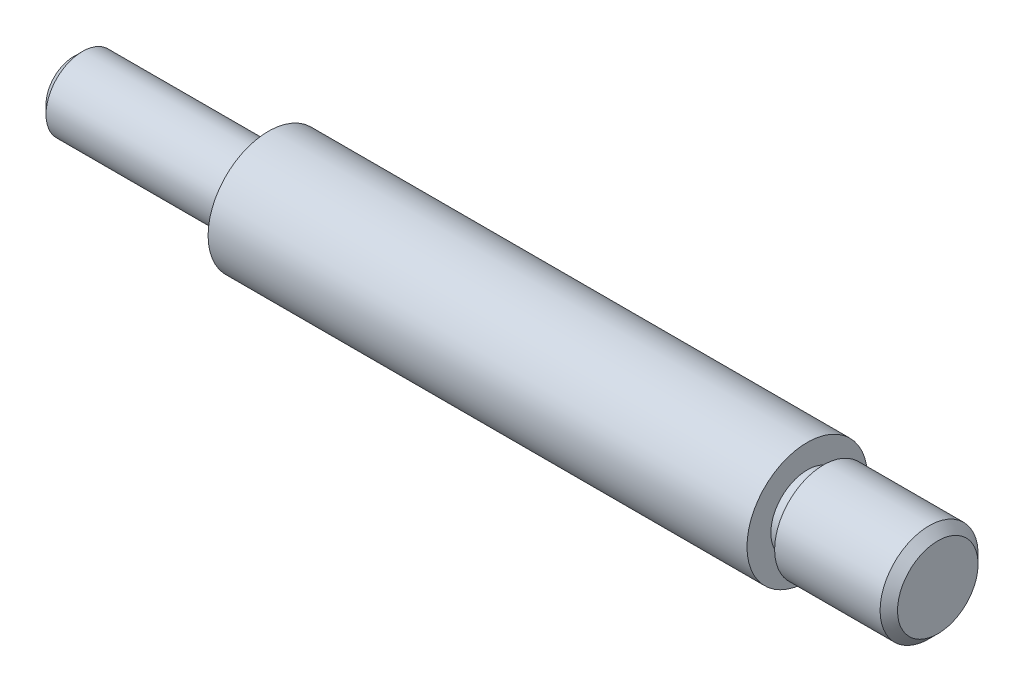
ISO-10303-21;
HEADER;
FILE_DESCRIPTION(('STEP AP214'),'2;1');
FILE_NAME('part.step','',(''),(''),'','','');
FILE_SCHEMA(('AUTOMOTIVE_DESIGN { 1 0 10303 214 1 1 1 1 }'));
ENDSEC;
DATA;
#1=APPLICATION_CONTEXT('core data for automotive mechanical design processes');
#2=APPLICATION_PROTOCOL_DEFINITION('international standard','automotive_design',2000,#1);
#3=PRODUCT_CONTEXT('',#1,'mechanical');
#4=PRODUCT('Part','Part','',(#3));
#5=PRODUCT_RELATED_PRODUCT_CATEGORY('part','',(#4));
#6=PRODUCT_DEFINITION_FORMATION('','',#4);
#7=PRODUCT_DEFINITION_CONTEXT('part definition',#1,'design');
#8=PRODUCT_DEFINITION('design','',#6,#7);
#9=PRODUCT_DEFINITION_SHAPE('','',#8);
#10=(LENGTH_UNIT() NAMED_UNIT(*) SI_UNIT(.MILLI.,.METRE.));
#11=(NAMED_UNIT(*) PLANE_ANGLE_UNIT() SI_UNIT($,.RADIAN.));
#12=(NAMED_UNIT(*) SI_UNIT($,.STERADIAN.) SOLID_ANGLE_UNIT());
#13=UNCERTAINTY_MEASURE_WITH_UNIT(LENGTH_MEASURE(1.E-05),#10,'distance_accuracy_value','');
#14=(GEOMETRIC_REPRESENTATION_CONTEXT(3) GLOBAL_UNCERTAINTY_ASSIGNED_CONTEXT((#13)) GLOBAL_UNIT_ASSIGNED_CONTEXT((#10,
#11,#12)) REPRESENTATION_CONTEXT('',''));
#15=CARTESIAN_POINT('',(0.,0.,0.));
#16=DIRECTION('',(0.,0.,1.));
#17=DIRECTION('',(1.,0.,0.));
#18=AXIS2_PLACEMENT_3D('',#15,#16,#17);
#19=CARTESIAN_POINT('',(-94.416079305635,17.0110482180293,0.));
#20=DIRECTION('',(1.,0.,0.));
#21=DIRECTION('',(0.,0.,-1.));
#22=AXIS2_PLACEMENT_3D('',#19,#20,#21);
#23=PLANE('',#22);
#24=CARTESIAN_POINT('',(-94.416079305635,17.0110482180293,0.));
#25=DIRECTION('',(1.,0.,0.));
#26=DIRECTION('',(0.,0.,-1.));
#27=AXIS2_PLACEMENT_3D('',#24,#25,#26);
#28=CIRCLE('',#27,6.36136268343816);
#29=CARTESIAN_POINT('',(-94.416079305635,17.0110482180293,-6.36136268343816));
#30=VERTEX_POINT('',#29);
#31=EDGE_CURVE('E360',#30,#30,#28,.F.);
#32=ORIENTED_EDGE('',*,*,#31,.T.);
#33=EDGE_LOOP('',(#32));
#34=FACE_BOUND('',#33,.T.);
#35=ADVANCED_FACE('F346',(#34),#23,.F.);
#36=CARTESIAN_POINT('',(-85.7760482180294,17.0110482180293,0.));
#37=DIRECTION('',(-1.,0.,0.));
#38=DIRECTION('',(0.,0.,1.));
#39=AXIS2_PLACEMENT_3D('',#36,#37,#38);
#40=CYLINDRICAL_SURFACE('',#39,8.36136268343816);
#41=CARTESIAN_POINT('',(-92.416079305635,17.0110482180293,0.));
#42=DIRECTION('',(1.,0.,0.));
#43=DIRECTION('',(0.,0.,-1.));
#44=AXIS2_PLACEMENT_3D('',#41,#42,#43);
#45=CIRCLE('',#44,8.36136268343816);
#46=CARTESIAN_POINT('',(-92.416079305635,17.0110482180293,-8.36136268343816));
#47=VERTEX_POINT('',#46);
#48=EDGE_CURVE('E356',#47,#47,#45,.T.);
#49=ORIENTED_EDGE('',*,*,#48,.T.);
#50=EDGE_LOOP('',(#49));
#51=FACE_BOUND('',#50,.T.);
#52=CARTESIAN_POINT('',(-49.7356918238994,17.0110482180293,0.));
#53=DIRECTION('',(-1.,0.,0.));
#54=DIRECTION('',(0.,0.,1.));
#55=AXIS2_PLACEMENT_3D('',#52,#53,#54);
#56=CIRCLE('',#55,8.36136268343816);
#57=CARTESIAN_POINT('',(-49.7356918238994,17.0110482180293,8.36136268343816));
#58=VERTEX_POINT('',#57);
#59=EDGE_CURVE('E365',#58,#58,#56,.T.);
#60=ORIENTED_EDGE('',*,*,#59,.T.);
#61=EDGE_LOOP('',(#60));
#62=FACE_BOUND('',#61,.T.);
#63=ADVANCED_FACE('F401',(#51,#62),#40,.T.);
#64=CARTESIAN_POINT('',(-49.7356918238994,25.3724109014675,0.));
#65=DIRECTION('',(1.,0.,0.));
#66=DIRECTION('',(0.,0.,-1.));
#67=AXIS2_PLACEMENT_3D('',#64,#65,#66);
#68=PLANE('',#67);
#69=ORIENTED_EDGE('',*,*,#59,.F.);
#70=EDGE_LOOP('',(#69));
#71=FACE_BOUND('',#70,.T.);
#72=CARTESIAN_POINT('',(-49.7356918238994,17.0110482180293,0.));
#73=DIRECTION('',(-1.,0.,0.));
#74=DIRECTION('',(0.,0.,1.));
#75=AXIS2_PLACEMENT_3D('',#72,#73,#74);
#76=CIRCLE('',#75,13.8394968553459);
#77=CARTESIAN_POINT('',(-49.7356918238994,17.0110482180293,13.8394968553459));
#78=VERTEX_POINT('',#77);
#79=EDGE_CURVE('E368',#78,#78,#76,.T.);
#80=ORIENTED_EDGE('',*,*,#79,.T.);
#81=EDGE_LOOP('',(#80));
#82=FACE_BOUND('',#81,.T.);
#83=ADVANCED_FACE('F406',(#71,#82),#68,.F.);
#84=CARTESIAN_POINT('',(-85.7760482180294,17.0110482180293,0.));
#85=DIRECTION('',(-1.,0.,0.));
#86=DIRECTION('',(0.,0.,1.));
#87=AXIS2_PLACEMENT_3D('',#84,#85,#86);
#88=CYLINDRICAL_SURFACE('',#87,13.8394968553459);
#89=ORIENTED_EDGE('',*,*,#79,.F.);
#90=EDGE_LOOP('',(#89));
#91=FACE_BOUND('',#90,.T.);
#92=CARTESIAN_POINT('',(73.9548113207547,17.0110482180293,0.));
#93=DIRECTION('',(-1.,0.,0.));
#94=DIRECTION('',(0.,0.,1.));
#95=AXIS2_PLACEMENT_3D('',#92,#93,#94);
#96=CIRCLE('',#95,13.8394968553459);
#97=CARTESIAN_POINT('',(73.9548113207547,17.0110482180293,13.8394968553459));
#98=VERTEX_POINT('',#97);
#99=EDGE_CURVE('E371',#98,#98,#96,.T.);
#100=ORIENTED_EDGE('',*,*,#99,.T.);
#101=EDGE_LOOP('',(#100));
#102=FACE_BOUND('',#101,.T.);
#103=ADVANCED_FACE('F425',(#91,#102),#88,.T.);
#104=CARTESIAN_POINT('',(73.9548113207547,30.8505450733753,0.));
#105=DIRECTION('',(-1.,0.,0.));
#106=DIRECTION('',(0.,0.,1.));
#107=AXIS2_PLACEMENT_3D('',#104,#105,#106);
#108=PLANE('',#107);
#109=ORIENTED_EDGE('',*,*,#99,.F.);
#110=EDGE_LOOP('',(#109));
#111=FACE_BOUND('',#110,.T.);
#112=CARTESIAN_POINT('',(73.9548113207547,17.0110482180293,0.));
#113=DIRECTION('',(-1.,0.,0.));
#114=DIRECTION('',(0.,0.,1.));
#115=AXIS2_PLACEMENT_3D('',#112,#113,#114);
#116=CIRCLE('',#115,8.36136268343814);
#117=CARTESIAN_POINT('',(73.9548113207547,17.0110482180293,8.36136268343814));
#118=VERTEX_POINT('',#117);
#119=EDGE_CURVE('E374',#118,#118,#116,.T.);
#120=ORIENTED_EDGE('',*,*,#119,.T.);
#121=EDGE_LOOP('',(#120));
#122=FACE_BOUND('',#121,.T.);
#123=ADVANCED_FACE('F431',(#111,#122),#108,.F.);
#124=CARTESIAN_POINT('',(-85.7760482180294,17.0110482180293,0.));
#125=DIRECTION('',(-1.,0.,0.));
#126=DIRECTION('',(0.,0.,1.));
#127=AXIS2_PLACEMENT_3D('',#124,#125,#126);
#128=CYLINDRICAL_SURFACE('',#127,8.36136268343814);
#129=ORIENTED_EDGE('',*,*,#119,.F.);
#130=EDGE_LOOP('',(#129));
#131=FACE_BOUND('',#130,.T.);
#132=CARTESIAN_POINT('',(77.7030083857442,17.0110482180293,0.));
#133=DIRECTION('',(-1.,0.,0.));
#134=DIRECTION('',(0.,0.,1.));
#135=AXIS2_PLACEMENT_3D('',#132,#133,#134);
#136=CIRCLE('',#135,8.36136268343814);
#137=CARTESIAN_POINT('',(77.7030083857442,17.0110482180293,8.36136268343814));
#138=VERTEX_POINT('',#137);
#139=EDGE_CURVE('E377',#138,#138,#136,.T.);
#140=ORIENTED_EDGE('',*,*,#139,.T.);
#141=EDGE_LOOP('',(#140));
#142=FACE_BOUND('',#141,.T.);
#143=ADVANCED_FACE('F397',(#131,#142),#128,.T.);
#144=CARTESIAN_POINT('',(77.7030083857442,25.3724109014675,0.));
#145=DIRECTION('',(1.,0.,0.));
#146=DIRECTION('',(0.,0.,-1.));
#147=AXIS2_PLACEMENT_3D('',#144,#145,#146);
#148=PLANE('',#147);
#149=ORIENTED_EDGE('',*,*,#139,.F.);
#150=EDGE_LOOP('',(#149));
#151=FACE_BOUND('',#150,.T.);
#152=CARTESIAN_POINT('',(77.7030083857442,17.0110482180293,0.));
#153=DIRECTION('',(-1.,0.,0.));
#154=DIRECTION('',(0.,0.,1.));
#155=AXIS2_PLACEMENT_3D('',#152,#153,#154);
#156=CIRCLE('',#155,11.2445911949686);
#157=CARTESIAN_POINT('',(77.7030083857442,17.0110482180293,11.2445911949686));
#158=VERTEX_POINT('',#157);
#159=EDGE_CURVE('E380',#158,#158,#156,.T.);
#160=ORIENTED_EDGE('',*,*,#159,.T.);
#161=EDGE_LOOP('',(#160));
#162=FACE_BOUND('',#161,.T.);
#163=ADVANCED_FACE('F384',(#151,#162),#148,.F.);
#164=CARTESIAN_POINT('',(-85.7760482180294,17.0110482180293,0.));
#165=DIRECTION('',(-1.,0.,0.));
#166=DIRECTION('',(0.,0.,1.));
#167=AXIS2_PLACEMENT_3D('',#164,#165,#166);
#168=CYLINDRICAL_SURFACE('',#167,11.2445911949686);
#169=CARTESIAN_POINT('',(101.914482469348,17.0110482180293,0.));
#170=DIRECTION('',(-1.,0.,0.));
#171=DIRECTION('',(0.,0.,1.));
#172=AXIS2_PLACEMENT_3D('',#169,#170,#171);
#173=CIRCLE('',#172,11.2445911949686);
#174=CARTESIAN_POINT('',(101.914482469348,17.0110482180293,11.2445911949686));
#175=VERTEX_POINT('',#174);
#176=EDGE_CURVE('E352',#175,#175,#173,.T.);
#177=ORIENTED_EDGE('',*,*,#176,.T.);
#178=EDGE_LOOP('',(#177));
#179=FACE_BOUND('',#178,.T.);
#180=ORIENTED_EDGE('',*,*,#159,.F.);
#181=EDGE_LOOP('',(#180));
#182=FACE_BOUND('',#181,.T.);
#183=ADVANCED_FACE('F386',(#179,#182),#168,.T.);
#184=CARTESIAN_POINT('',(103.914482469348,17.0110482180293,0.));
#185=DIRECTION('',(-1.,0.,0.));
#186=DIRECTION('',(0.,0.,1.));
#187=AXIS2_PLACEMENT_3D('',#184,#185,#186);
#188=PLANE('',#187);
#189=CARTESIAN_POINT('',(103.914482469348,17.0110482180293,0.));
#190=DIRECTION('',(-1.,0.,0.));
#191=DIRECTION('',(0.,0.,1.));
#192=AXIS2_PLACEMENT_3D('',#189,#190,#191);
#193=CIRCLE('',#192,9.24459119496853);
#194=CARTESIAN_POINT('',(103.914482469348,17.0110482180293,9.24459119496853));
#195=VERTEX_POINT('',#194);
#196=EDGE_CURVE('E10',#195,#195,#193,.F.);
#197=ORIENTED_EDGE('',*,*,#196,.T.);
#198=EDGE_LOOP('',(#197));
#199=FACE_BOUND('',#198,.T.);
#200=ADVANCED_FACE('F388',(#199),#188,.F.);
#201=CARTESIAN_POINT('',(-94.416079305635,17.0110482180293,0.));
#202=DIRECTION('',(1.,0.,0.));
#203=DIRECTION('',(0.,0.,-1.));
#204=AXIS2_PLACEMENT_3D('',#201,#202,#203);
#205=CONICAL_SURFACE('',#204,6.36136268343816,0.785398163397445);
#206=ORIENTED_EDGE('',*,*,#48,.F.);
#207=EDGE_LOOP('',(#206));
#208=FACE_BOUND('',#207,.T.);
#209=ORIENTED_EDGE('',*,*,#31,.F.);
#210=EDGE_LOOP('',(#209));
#211=FACE_BOUND('',#210,.T.);
#212=ADVANCED_FACE('F394',(#208,#211),#205,.T.);
#213=CARTESIAN_POINT('',(101.914482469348,17.0110482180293,0.));
#214=DIRECTION('',(-1.,0.,0.));
#215=DIRECTION('',(0.,0.,1.));
#216=AXIS2_PLACEMENT_3D('',#213,#214,#215);
#217=CONICAL_SURFACE('',#216,11.2445911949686,0.785398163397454);
#218=ORIENTED_EDGE('',*,*,#196,.F.);
#219=EDGE_LOOP('',(#218));
#220=FACE_BOUND('',#219,.T.);
#221=ORIENTED_EDGE('',*,*,#176,.F.);
#222=EDGE_LOOP('',(#221));
#223=FACE_BOUND('',#222,.T.);
#224=ADVANCED_FACE('F411',(#220,#223),#217,.T.);
#225=CLOSED_SHELL('',(#35,#63,#83,#103,#123,#143,#163,#183,#200,#212,#224));
#226=MANIFOLD_SOLID_BREP('B2',#225);
#227=ADVANCED_BREP_SHAPE_REPRESENTATION('',(#18,#226),#14);
#228=SHAPE_DEFINITION_REPRESENTATION(#9,#227);
ENDSEC;
END-ISO-10303-21;
